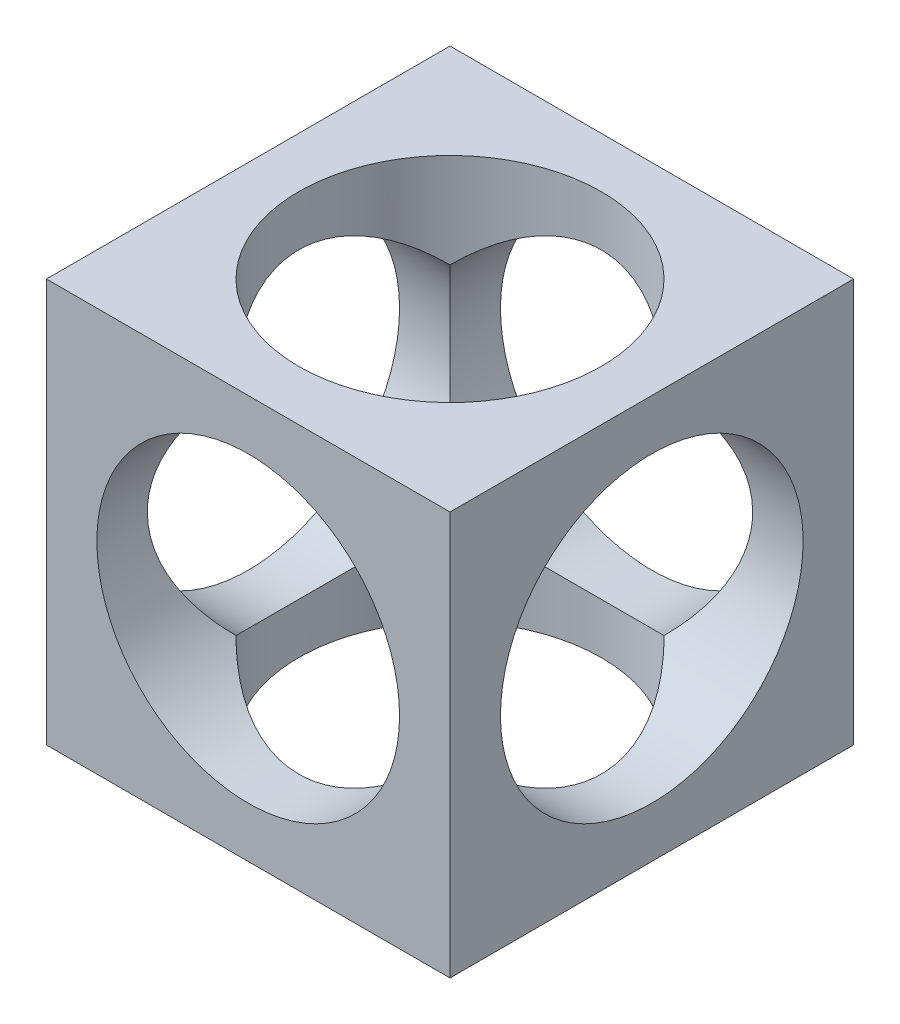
from build123d import *

# Parameters (mm, degrees)
SKETCH1_W           = 40
SKETCH1_H           = 40
BOSS_EXTRUDE2_DEPTH = 20
SKETCH2_R           = 15
CUT_EXTRUDE1_DEPTH  = 49.989794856
SKETCH3_R           = 15
CUT_EXTRUDE2_DEPTH  = 49.989794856
SKETCH4_R           = 15
CUT_EXTRUDE3_DEPTH  = 49.989794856


with BuildPart() as part:
    # Sketch1 → Boss-Extrude2 (new, symmetric)
    with BuildSketch(Plane(origin=(0, 0, 0), x_dir=(1, 0, 0), z_dir=(0, 1, 0))):
        Rectangle(SKETCH1_W, SKETCH1_H)
    extrude(amount=BOSS_EXTRUDE2_DEPTH, both=True)

    # Sketch2 → Cut-Extrude1 (cut, through all)
    with BuildSketch(Plane(origin=(20, 0, 0), x_dir=(0, 0, -1), z_dir=(1, 0, 0))):
        Circle(SKETCH2_R)
    extrude(amount=-CUT_EXTRUDE1_DEPTH, mode=Mode.SUBTRACT)

    # Sketch3 → Cut-Extrude2 (cut, through all)
    with BuildSketch(Plane(origin=(0, 0, -20), x_dir=(-1, 0, 0), z_dir=(0, 0, -1))):
        Circle(SKETCH3_R)
    extrude(amount=-CUT_EXTRUDE2_DEPTH, mode=Mode.SUBTRACT)

    # Sketch4 → Cut-Extrude3 (cut, through all)
    with BuildSketch(Plane(origin=(0, 20, 0), x_dir=(1, 0, 0), z_dir=(0, 1, 0))):
        with Locations(Location((0, 0, 0), (0, 0, 270))):
            Circle(SKETCH4_R)
    extrude(amount=-CUT_EXTRUDE3_DEPTH, mode=Mode.SUBTRACT)


solid = part.part
